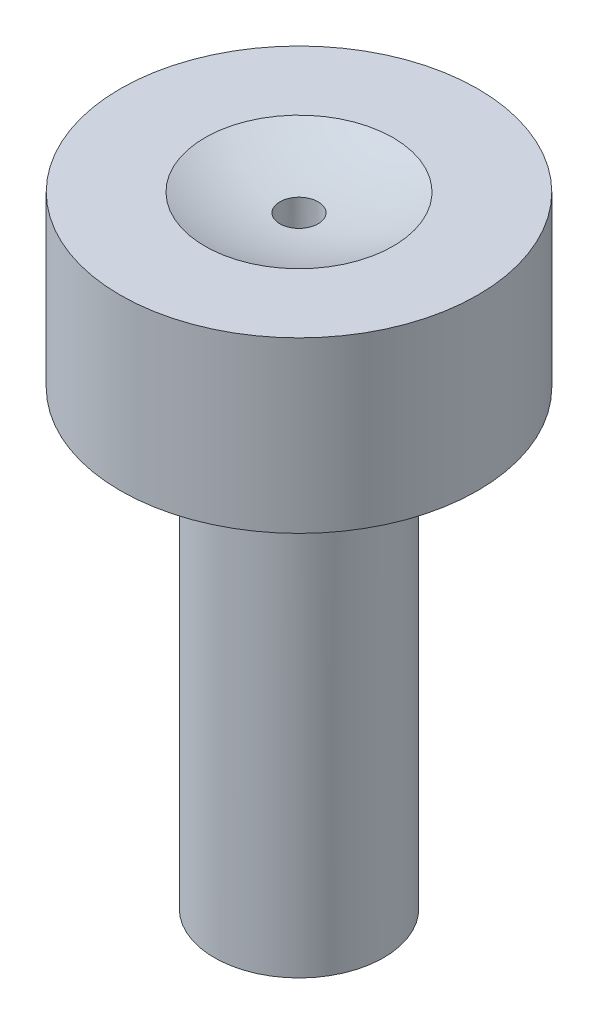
ISO-10303-21;
HEADER;
FILE_DESCRIPTION(('STEP AP214'),'2;1');
FILE_NAME('part.step','',(''),(''),'','','');
FILE_SCHEMA(('AUTOMOTIVE_DESIGN { 1 0 10303 214 1 1 1 1 }'));
ENDSEC;
DATA;
#1=APPLICATION_CONTEXT('core data for automotive mechanical design processes');
#2=APPLICATION_PROTOCOL_DEFINITION('international standard','automotive_design',2000,#1);
#3=PRODUCT_CONTEXT('',#1,'mechanical');
#4=PRODUCT('Part','Part','',(#3));
#5=PRODUCT_RELATED_PRODUCT_CATEGORY('part','',(#4));
#6=PRODUCT_DEFINITION_FORMATION('','',#4);
#7=PRODUCT_DEFINITION_CONTEXT('part definition',#1,'design');
#8=PRODUCT_DEFINITION('design','',#6,#7);
#9=PRODUCT_DEFINITION_SHAPE('','',#8);
#10=(LENGTH_UNIT() NAMED_UNIT(*) SI_UNIT(.MILLI.,.METRE.));
#11=(NAMED_UNIT(*) PLANE_ANGLE_UNIT() SI_UNIT($,.RADIAN.));
#12=(NAMED_UNIT(*) SI_UNIT($,.STERADIAN.) SOLID_ANGLE_UNIT());
#13=UNCERTAINTY_MEASURE_WITH_UNIT(LENGTH_MEASURE(1.E-05),#10,'distance_accuracy_value','');
#14=(GEOMETRIC_REPRESENTATION_CONTEXT(3) GLOBAL_UNCERTAINTY_ASSIGNED_CONTEXT((#13)) GLOBAL_UNIT_ASSIGNED_CONTEXT((#10,
#11,#12)) REPRESENTATION_CONTEXT('',''));
#15=CARTESIAN_POINT('',(0.,0.,0.));
#16=DIRECTION('',(0.,0.,1.));
#17=DIRECTION('',(1.,0.,0.));
#18=AXIS2_PLACEMENT_3D('',#15,#16,#17);
#19=CARTESIAN_POINT('',(-19.228,48.,45.772));
#20=DIRECTION('',(0.,-1.,0.));
#21=DIRECTION('',(1.,0.,0.));
#22=AXIS2_PLACEMENT_3D('',#19,#20,#21);
#23=PLANE('',#22);
#24=CARTESIAN_POINT('',(11.999999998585,48.0000000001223,65.));
#25=CARTESIAN_POINT('',(11.999999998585,48.0000000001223,88.9999999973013));
#26=CARTESIAN_POINT('',(-11.999999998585,48.0000000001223,88.9999999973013));
#27=CARTESIAN_POINT('',(-11.999999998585,48.0000000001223,65.));
#28=(BOUNDED_CURVE() B_SPLINE_CURVE(3,(#24,#25,#26,#27),.UNSPECIFIED.,.F.,
.F.) B_SPLINE_CURVE_WITH_KNOTS((4,4),(0.,1.),
.UNSPECIFIED.) CURVE() GEOMETRIC_REPRESENTATION_ITEM() RATIONAL_B_SPLINE_CURVE((0.956578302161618,
0.318859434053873,0.318859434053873,0.956578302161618)) REPRESENTATION_ITEM(''));
#29=CARTESIAN_POINT('',(-11.9999999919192,48.0000000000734,65.));
#30=VERTEX_POINT('',#29);
#31=CARTESIAN_POINT('',(11.9999999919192,48.0000000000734,65.));
#32=VERTEX_POINT('',#31);
#33=EDGE_CURVE('E48',#30,#32,#28,.F.);
#34=ORIENTED_EDGE('',*,*,#33,.T.);
#35=CARTESIAN_POINT('',(-11.999999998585,48.0000000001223,65.));
#36=CARTESIAN_POINT('',(-11.999999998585,48.0000000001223,41.0000000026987));
#37=CARTESIAN_POINT('',(11.999999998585,48.0000000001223,41.0000000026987));
#38=CARTESIAN_POINT('',(11.999999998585,48.0000000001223,65.));
#39=(BOUNDED_CURVE() B_SPLINE_CURVE(3,(#35,#36,#37,#38),.UNSPECIFIED.,.F.,
.F.) B_SPLINE_CURVE_WITH_KNOTS((4,4),(0.,1.),
.UNSPECIFIED.) CURVE() GEOMETRIC_REPRESENTATION_ITEM() RATIONAL_B_SPLINE_CURVE((0.956578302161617,
0.318859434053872,0.318859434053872,0.956578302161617)) REPRESENTATION_ITEM(''));
#40=EDGE_CURVE('E42',#32,#30,#39,.F.);
#41=ORIENTED_EDGE('',*,*,#40,.T.);
#42=EDGE_LOOP('',(#34,#41));
#43=FACE_BOUND('',#42,.T.);
#44=CARTESIAN_POINT('',(0.,48.,65.));
#45=DIRECTION('',(0.,-1.,0.));
#46=DIRECTION('',(0.,0.,-1.));
#47=AXIS2_PLACEMENT_3D('',#44,#45,#46);
#48=CIRCLE('',#47,19.);
#49=CARTESIAN_POINT('',(0.,48.,46.));
#50=VERTEX_POINT('',#49);
#51=EDGE_CURVE('E20',#50,#50,#48,.T.);
#52=ORIENTED_EDGE('',*,*,#51,.T.);
#53=EDGE_LOOP('',(#52));
#54=FACE_BOUND('',#53,.T.);
#55=ADVANCED_FACE('F16',(#43,#54),#23,.T.);
#56=CARTESIAN_POINT('',(0.,66.,65.));
#57=DIRECTION('',(0.,-1.,0.));
#58=DIRECTION('',(0.,0.,-1.));
#59=AXIS2_PLACEMENT_3D('',#56,#57,#58);
#60=CYLINDRICAL_SURFACE('',#59,19.);
#61=CARTESIAN_POINT('',(0.,66.,65.));
#62=DIRECTION('',(0.,-1.,0.));
#63=DIRECTION('',(0.,0.,-1.));
#64=AXIS2_PLACEMENT_3D('',#61,#62,#63);
#65=CIRCLE('',#64,19.);
#66=CARTESIAN_POINT('',(0.,66.,46.));
#67=VERTEX_POINT('',#66);
#68=EDGE_CURVE('E114',#67,#67,#65,.F.);
#69=ORIENTED_EDGE('',*,*,#68,.F.);
#70=EDGE_LOOP('',(#69));
#71=FACE_BOUND('',#70,.T.);
#72=ORIENTED_EDGE('',*,*,#51,.F.);
#73=EDGE_LOOP('',(#72));
#74=FACE_BOUND('',#73,.T.);
#75=ADVANCED_FACE('F78',(#71,#74),#60,.T.);
#76=CARTESIAN_POINT('',(12.29950025,47.985012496,65.));
#77=CARTESIAN_POINT('',(12.29950025,47.985012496,89.5990005));
#78=CARTESIAN_POINT('',(-12.29950025,47.985012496,89.5990005));
#79=CARTESIAN_POINT('',(-12.29950025,47.985012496,65.));
#80=CARTESIAN_POINT('',(10.259838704,48.189661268,65.));
#81=CARTESIAN_POINT('',(10.259838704,48.189661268,85.519677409));
#82=CARTESIAN_POINT('',(-10.259838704,48.189661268,85.519677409));
#83=CARTESIAN_POINT('',(-10.259838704,48.189661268,65.));
#84=CARTESIAN_POINT('',(8.810338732,46.740161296,65.));
#85=CARTESIAN_POINT('',(8.810338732,46.740161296,82.620677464));
#86=CARTESIAN_POINT('',(-8.810338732,46.740161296,82.620677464));
#87=CARTESIAN_POINT('',(-8.810338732,46.740161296,65.));
#88=CARTESIAN_POINT('',(9.014987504,44.70049975,65.));
#89=CARTESIAN_POINT('',(9.014987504,44.70049975,83.029975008));
#90=CARTESIAN_POINT('',(-9.014987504,44.70049975,83.029975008));
#91=CARTESIAN_POINT('',(-9.014987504,44.70049975,65.));
#92=(BOUNDED_SURFACE() B_SPLINE_SURFACE(3,3,((#76,#77,#78,#79),(#80,#81,#82,#83),(#84,#85,#86,
#87),(#88,#89,#90,#91)),.UNSPECIFIED.,.F.,.F.,.F.) B_SPLINE_SURFACE_WITH_KNOTS((4,4),(4,4),(0.,
1.),(0.,1.),.UNSPECIFIED.) GEOMETRIC_REPRESENTATION_ITEM() RATIONAL_B_SPLINE_SURFACE(((1.,
0.333333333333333,0.333333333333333,1.),(0.755320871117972,0.251773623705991,0.251773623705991,
0.755320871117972),(0.755320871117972,0.251773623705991,0.251773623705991,0.755320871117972),
(1.,0.333333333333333,0.333333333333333,1.))) REPRESENTATION_ITEM('') SURFACE());
#93=CARTESIAN_POINT('',(12.29950025,47.985012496,65.));
#94=CARTESIAN_POINT('',(10.259838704,48.189661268,65.));
#95=CARTESIAN_POINT('',(8.810338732,46.740161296,65.));
#96=CARTESIAN_POINT('',(9.014987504,44.70049975,65.));
#97=(BOUNDED_CURVE() B_SPLINE_CURVE(3,(#93,#94,#95,#96),.UNSPECIFIED.,.F.,
.F.) B_SPLINE_CURVE_WITH_KNOTS((4,4),(0.,1.),
.UNSPECIFIED.) CURVE() GEOMETRIC_REPRESENTATION_ITEM() RATIONAL_B_SPLINE_CURVE((1.,
0.755320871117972,0.755320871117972,1.)) REPRESENTATION_ITEM(''));
#98=CARTESIAN_POINT('',(8.99999999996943,45.,65.0000000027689));
#99=VERTEX_POINT('',#98);
#100=EDGE_CURVE('E35',#99,#32,#97,.F.);
#101=CARTESIAN_POINT('',(-12.29950025,47.985012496,65.));
#102=CARTESIAN_POINT('',(-10.259838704,48.189661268,65.));
#103=CARTESIAN_POINT('',(-8.810338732,46.740161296,65.));
#104=CARTESIAN_POINT('',(-9.014987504,44.70049975,65.));
#105=(BOUNDED_CURVE() B_SPLINE_CURVE(3,(#101,#102,#103,#104),.UNSPECIFIED.,.F.,
.F.) B_SPLINE_CURVE_WITH_KNOTS((4,4),(0.,1.),
.UNSPECIFIED.) CURVE() GEOMETRIC_REPRESENTATION_ITEM() RATIONAL_B_SPLINE_CURVE((1.,
0.755320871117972,0.755320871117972,1.)) REPRESENTATION_ITEM(''));
#106=CARTESIAN_POINT('',(-8.99999999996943,45.,65.0000000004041));
#107=VERTEX_POINT('',#106);
#108=EDGE_CURVE('E51',#30,#107,#105,.T.);
#109=CARTESIAN_POINT('',(0.,45.,65.));
#110=DIRECTION('',(0.,-1.,0.));
#111=DIRECTION('',(-1.,0.,0.));
#112=AXIS2_PLACEMENT_3D('',#109,#110,#111);
#113=CIRCLE('',#112,9.);
#114=EDGE_CURVE('E112',#107,#99,#113,.F.);
#115=ORIENTED_EDGE('',*,*,#100,.T.);
#116=ORIENTED_EDGE('',*,*,#33,.F.);
#117=ORIENTED_EDGE('',*,*,#108,.T.);
#118=ORIENTED_EDGE('',*,*,#114,.T.);
#119=EDGE_LOOP('',(#115,#116,#117,#118));
#120=FACE_BOUND('',#119,.T.);
#121=ADVANCED_FACE('F50',(#120),#92,.F.);
#122=CARTESIAN_POINT('',(-12.29950025,47.985012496,65.));
#123=CARTESIAN_POINT('',(-12.29950025,47.985012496,40.4009995));
#124=CARTESIAN_POINT('',(12.29950025,47.985012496,40.4009995));
#125=CARTESIAN_POINT('',(12.29950025,47.985012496,65.));
#126=CARTESIAN_POINT('',(-10.259838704,48.189661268,65.));
#127=CARTESIAN_POINT('',(-10.259838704,48.189661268,44.480322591));
#128=CARTESIAN_POINT('',(10.259838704,48.189661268,44.480322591));
#129=CARTESIAN_POINT('',(10.259838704,48.189661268,65.));
#130=CARTESIAN_POINT('',(-8.810338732,46.740161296,65.));
#131=CARTESIAN_POINT('',(-8.810338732,46.740161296,47.379322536));
#132=CARTESIAN_POINT('',(8.810338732,46.740161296,47.379322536));
#133=CARTESIAN_POINT('',(8.810338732,46.740161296,65.));
#134=CARTESIAN_POINT('',(-9.014987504,44.70049975,65.));
#135=CARTESIAN_POINT('',(-9.014987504,44.70049975,46.970024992));
#136=CARTESIAN_POINT('',(9.014987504,44.70049975,46.970024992));
#137=CARTESIAN_POINT('',(9.014987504,44.70049975,65.));
#138=(BOUNDED_SURFACE() B_SPLINE_SURFACE(3,3,((#122,#123,#124,#125),(#126,#127,#128,#129),(#130,
#131,#132,#133),(#134,#135,#136,#137)),.UNSPECIFIED.,.F.,.F.,
.F.) B_SPLINE_SURFACE_WITH_KNOTS((4,4),(4,4),(0.,1.),(0.,1.),
.UNSPECIFIED.) GEOMETRIC_REPRESENTATION_ITEM() RATIONAL_B_SPLINE_SURFACE(((1.,0.333333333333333,
0.333333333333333,1.),(0.755320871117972,0.251773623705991,0.251773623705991,0.755320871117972),
(0.755320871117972,0.251773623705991,0.251773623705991,0.755320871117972),(1.,0.333333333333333,
0.333333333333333,1.))) REPRESENTATION_ITEM('') SURFACE());
#139=CARTESIAN_POINT('',(0.,45.,65.));
#140=DIRECTION('',(0.,-1.,0.));
#141=DIRECTION('',(-1.,0.,0.));
#142=AXIS2_PLACEMENT_3D('',#139,#140,#141);
#143=CIRCLE('',#142,9.);
#144=EDGE_CURVE('E58',#99,#107,#143,.F.);
#145=ORIENTED_EDGE('',*,*,#144,.T.);
#146=ORIENTED_EDGE('',*,*,#108,.F.);
#147=ORIENTED_EDGE('',*,*,#40,.F.);
#148=ORIENTED_EDGE('',*,*,#100,.F.);
#149=EDGE_LOOP('',(#145,#146,#147,#148));
#150=FACE_BOUND('',#149,.T.);
#151=ADVANCED_FACE('F56',(#150),#138,.F.);
#152=CARTESIAN_POINT('',(19.228,66.,45.772));
#153=DIRECTION('',(0.,1.,0.));
#154=DIRECTION('',(-1.,0.,0.));
#155=AXIS2_PLACEMENT_3D('',#152,#153,#154);
#156=PLANE('',#155);
#157=CARTESIAN_POINT('',(0.,66.,65.));
#158=DIRECTION('',(0.,-1.,0.));
#159=DIRECTION('',(0.,0.,-1.));
#160=AXIS2_PLACEMENT_3D('',#157,#158,#159);
#161=CIRCLE('',#160,10.);
#162=CARTESIAN_POINT('',(0.,66.,55.));
#163=VERTEX_POINT('',#162);
#164=EDGE_CURVE('E118',#163,#163,#161,.F.);
#165=ORIENTED_EDGE('',*,*,#164,.F.);
#166=EDGE_LOOP('',(#165));
#167=FACE_BOUND('',#166,.T.);
#168=ORIENTED_EDGE('',*,*,#68,.T.);
#169=EDGE_LOOP('',(#168));
#170=FACE_BOUND('',#169,.T.);
#171=ADVANCED_FACE('F80',(#167,#170),#156,.T.);
#172=CARTESIAN_POINT('',(0.,45.,65.));
#173=DIRECTION('',(0.,-1.,0.));
#174=DIRECTION('',(0.,0.,-1.));
#175=AXIS2_PLACEMENT_3D('',#172,#173,#174);
#176=CYLINDRICAL_SURFACE('',#175,9.);
#177=CARTESIAN_POINT('',(0.,0.,65.));
#178=DIRECTION('',(0.,-1.,0.));
#179=DIRECTION('',(0.,0.,-1.));
#180=AXIS2_PLACEMENT_3D('',#177,#178,#179);
#181=CIRCLE('',#180,9.);
#182=CARTESIAN_POINT('',(0.,0.,56.));
#183=VERTEX_POINT('',#182);
#184=EDGE_CURVE('E179',#183,#183,#181,.T.);
#185=ORIENTED_EDGE('',*,*,#184,.F.);
#186=EDGE_LOOP('',(#185));
#187=FACE_BOUND('',#186,.T.);
#188=ORIENTED_EDGE('',*,*,#144,.F.);
#189=ORIENTED_EDGE('',*,*,#114,.F.);
#190=EDGE_LOOP('',(#188,#189));
#191=FACE_BOUND('',#190,.T.);
#192=ADVANCED_FACE('F83',(#187,#191),#176,.T.);
#193=CARTESIAN_POINT('',(0.,90.,65.));
#194=DIRECTION('',(0.,-1.,0.));
#195=DIRECTION('',(1.,0.,0.));
#196=AXIS2_PLACEMENT_3D('',#193,#194,#195);
#197=SPHERICAL_SURFACE('',#196,26.);
#198=CARTESIAN_POINT('',(0.,64.079645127,65.));
#199=DIRECTION('',(0.,-1.,0.));
#200=DIRECTION('',(-1.,0.,0.));
#201=AXIS2_PLACEMENT_3D('',#198,#199,#200);
#202=CIRCLE('',#201,2.033519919);
#203=CARTESIAN_POINT('',(-2.033519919,64.079645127,65.));
#204=VERTEX_POINT('',#203);
#205=EDGE_CURVE('E26',#204,#204,#202,.F.);
#206=ORIENTED_EDGE('',*,*,#205,.F.);
#207=EDGE_LOOP('',(#206));
#208=FACE_BOUND('',#207,.T.);
#209=ORIENTED_EDGE('',*,*,#164,.T.);
#210=EDGE_LOOP('',(#209));
#211=FACE_BOUND('',#210,.T.);
#212=ADVANCED_FACE('F90',(#208,#211),#197,.F.);
#213=CARTESIAN_POINT('',(-9.108,0.,55.892));
#214=DIRECTION('',(0.,-1.,0.));
#215=DIRECTION('',(1.,0.,0.));
#216=AXIS2_PLACEMENT_3D('',#213,#214,#215);
#217=PLANE('',#216);
#218=CARTESIAN_POINT('',(0.,0.,65.));
#219=DIRECTION('',(0.,-1.,0.));
#220=DIRECTION('',(0.,0.,-1.));
#221=AXIS2_PLACEMENT_3D('',#218,#219,#220);
#222=CIRCLE('',#221,3.152034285);
#223=CARTESIAN_POINT('',(0.,0.,61.847965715));
#224=VERTEX_POINT('',#223);
#225=EDGE_CURVE('E11',#224,#224,#222,.T.);
#226=ORIENTED_EDGE('',*,*,#225,.F.);
#227=EDGE_LOOP('',(#226));
#228=FACE_BOUND('',#227,.T.);
#229=ORIENTED_EDGE('',*,*,#184,.T.);
#230=EDGE_LOOP('',(#229));
#231=FACE_BOUND('',#230,.T.);
#232=ADVANCED_FACE('F18',(#228,#231),#217,.T.);
#233=CARTESIAN_POINT('',(0.,64.079645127,65.));
#234=DIRECTION('',(0.,-1.,0.));
#235=DIRECTION('',(0.,0.,-1.));
#236=AXIS2_PLACEMENT_3D('',#233,#234,#235);
#237=CONICAL_SURFACE('',#236,2.033519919,0.0174532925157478);
#238=ORIENTED_EDGE('',*,*,#225,.T.);
#239=EDGE_LOOP('',(#238));
#240=FACE_BOUND('',#239,.T.);
#241=ORIENTED_EDGE('',*,*,#205,.T.);
#242=EDGE_LOOP('',(#241));
#243=FACE_BOUND('',#242,.T.);
#244=ADVANCED_FACE('F96',(#240,#243),#237,.F.);
#245=CLOSED_SHELL('',(#55,#75,#121,#151,#171,#192,#212,#232,#244));
#246=MANIFOLD_SOLID_BREP('B1',#245);
#247=ADVANCED_BREP_SHAPE_REPRESENTATION('',(#18,#246),#14);
#248=SHAPE_DEFINITION_REPRESENTATION(#9,#247);
ENDSEC;
END-ISO-10303-21;
